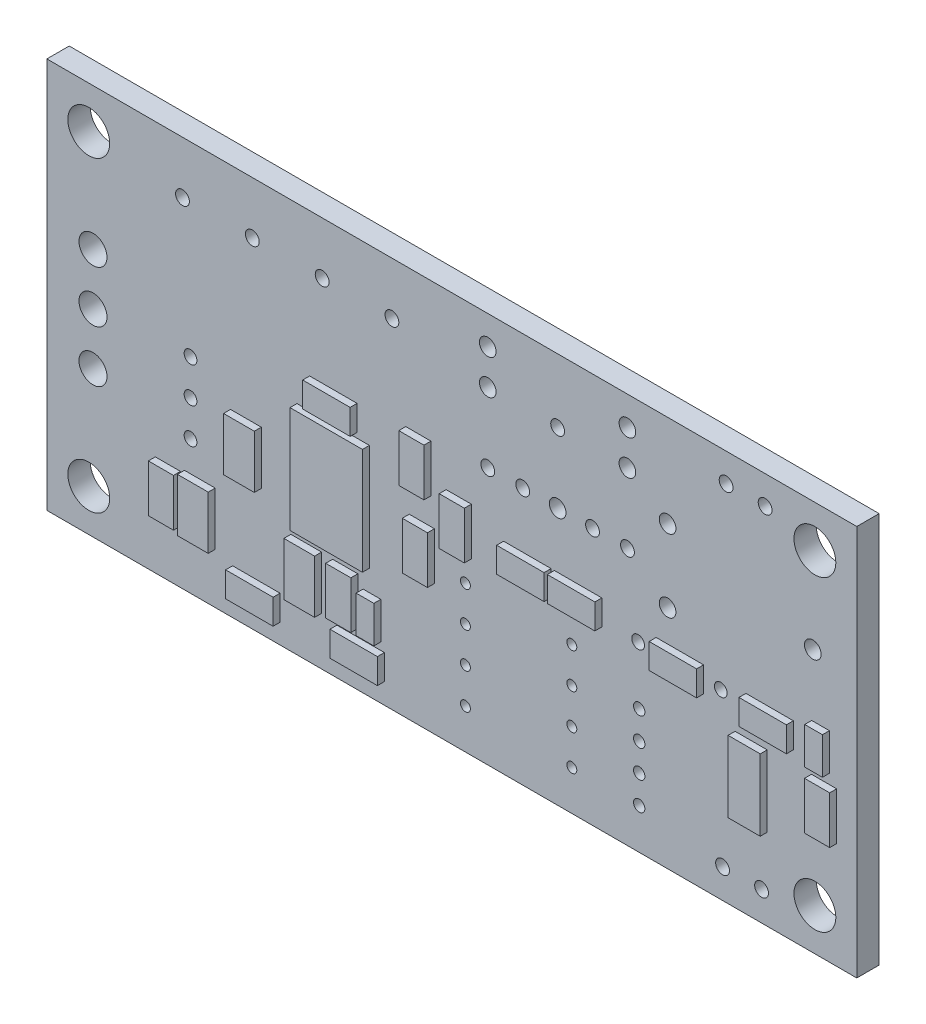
from build123d import *

# Parameters (mm, degrees)
PCB_DGB_W          = 57.99836
PCB_DGB_H          = 28.00096
PCB_DGB_R          = 0.4953
PCB_DGB_R_2        = 0.4064
PCB_DGB_R_3        = 0.3556
PCB_DGB_R_4        = 0.5969
PCB_DGB_R_5        = 0.4572
PCB_DGB_R_6        = 1.0033
PCB_DGB_R_7        = 1.4986
BOSS_EXTRU_1_DEPTH = 1.6
ESQUISSE2_W        = 3.39852
ESQUISSE2_H        = 1.80086
ESQUISSE2_W_2      = 1.27
ESQUISSE2_H_2      = 2.6416
ESQUISSE2_W_3      = 1.80086
ESQUISSE2_H_3      = 3.39852
ESQUISSE2_W_4      = 2.20218
ESQUISSE2_H_4      = 3.80238
ESQUISSE2_H_5      = 3.79984
ESQUISSE2_W_5      = 2.30124
ESQUISSE2_H_6      = 5.11048
BOSS_EXTRU_2_DEPTH = 0.5


with BuildPart() as part:
    # PCB DGB → Boss.-Extru.1 (new body)
    with BuildSketch(Plane.XY):
        with Locations((28.99918, 14.00048)):
            Rectangle(PCB_DGB_W, PCB_DGB_H)
        with Locations((51.181, 2.09296)):
            Circle(PCB_DGB_R, mode=Mode.SUBTRACT)
        with Locations((48.387, 2.09296)):
            Circle(PCB_DGB_R, mode=Mode.SUBTRACT)
        with Locations((51.435, 25.96896)):
            Circle(PCB_DGB_R, mode=Mode.SUBTRACT)
        with Locations((48.641, 25.96896)):
            Circle(PCB_DGB_R, mode=Mode.SUBTRACT)
        with Locations((24.70912, 24.25446)):
            Circle(PCB_DGB_R, mode=Mode.SUBTRACT)
        with Locations((19.71294, 24.25446)):
            Circle(PCB_DGB_R, mode=Mode.SUBTRACT)
        with Locations((14.71168, 24.25446)):
            Circle(PCB_DGB_R, mode=Mode.SUBTRACT)
        with Locations((9.71042, 24.257)):
            Circle(PCB_DGB_R, mode=Mode.SUBTRACT)
        with Locations((36.576, 23.42896)):
            Circle(PCB_DGB_R, mode=Mode.SUBTRACT)
        with Locations((41.57726, 18.4277)):
            Circle(PCB_DGB_R, mode=Mode.SUBTRACT)
        with Locations((39.07536, 18.4277)):
            Circle(PCB_DGB_R, mode=Mode.SUBTRACT)
        with Locations((31.5722, 18.4277)):
            Circle(PCB_DGB_R, mode=Mode.SUBTRACT)
        with Locations((34.0741, 18.4277)):
            Circle(PCB_DGB_R, mode=Mode.SUBTRACT)
        with Locations((42.418, 2.90322)):
            Circle(PCB_DGB_R_2, mode=Mode.SUBTRACT)
        with Locations((42.418, 4.91236)):
            Circle(PCB_DGB_R_2, mode=Mode.SUBTRACT)
        with Locations((42.418, 6.89356)):
            Circle(PCB_DGB_R_2, mode=Mode.SUBTRACT)
        with Locations((42.418, 8.90016)):
            Circle(PCB_DGB_R_2, mode=Mode.SUBTRACT)
        with Locations((29.972, 10.47496)):
            Circle(PCB_DGB_R_3, mode=Mode.SUBTRACT)
        with Locations((29.972, 7.93496)):
            Circle(PCB_DGB_R_3, mode=Mode.SUBTRACT)
        with Locations((29.972, 5.39496)):
            Circle(PCB_DGB_R_3, mode=Mode.SUBTRACT)
        with Locations((29.972, 2.85496)):
            Circle(PCB_DGB_R_3, mode=Mode.SUBTRACT)
        with Locations((37.592, 2.85496)):
            Circle(PCB_DGB_R_3, mode=Mode.SUBTRACT)
        with Locations((37.592, 5.39496)):
            Circle(PCB_DGB_R_3, mode=Mode.SUBTRACT)
        with Locations((37.592, 7.93496)):
            Circle(PCB_DGB_R_3, mode=Mode.SUBTRACT)
        with Locations((37.592, 10.47496)):
            Circle(PCB_DGB_R_3, mode=Mode.SUBTRACT)
        with Locations((54.84876, 18.796)):
            Circle(PCB_DGB_R_4, mode=Mode.SUBTRACT)
        with Locations((44.45, 21.3995)):
            Circle(PCB_DGB_R_4, mode=Mode.SUBTRACT)
        with Locations((44.45, 16.20012)):
            Circle(PCB_DGB_R_4, mode=Mode.SUBTRACT)
        with Locations((36.576, 18.4277)):
            Circle(PCB_DGB_R_4, mode=Mode.SUBTRACT)
        with Locations((41.57218, 23.42896)):
            Circle(PCB_DGB_R_4, mode=Mode.SUBTRACT)
        with Locations((31.5722, 23.42896)):
            Circle(PCB_DGB_R_4, mode=Mode.SUBTRACT)
        with Locations((41.57218, 25.92832)):
            Circle(PCB_DGB_R_4, mode=Mode.SUBTRACT)
        with Locations((31.5722, 25.92832)):
            Circle(PCB_DGB_R_4, mode=Mode.SUBTRACT)
        with Locations((42.3418, 13.01496)):
            Circle(PCB_DGB_R_5, mode=Mode.SUBTRACT)
        with Locations((48.26, 13.01496)):
            Circle(PCB_DGB_R_5, mode=Mode.SUBTRACT)
        with Locations((10.287, 9.58596)):
            Circle(PCB_DGB_R_5, mode=Mode.SUBTRACT)
        with Locations((10.287, 12.12596)):
            Circle(PCB_DGB_R_5, mode=Mode.SUBTRACT)
        with Locations((10.287, 14.66596)):
            Circle(PCB_DGB_R_5, mode=Mode.SUBTRACT)
        with Locations((3.302, 17.84096)):
            Circle(PCB_DGB_R_6, mode=Mode.SUBTRACT)
        with Locations((3.302, 14.14018)):
            Circle(PCB_DGB_R_6, mode=Mode.SUBTRACT)
        with Locations((3.302, 10.44194)):
            Circle(PCB_DGB_R_6, mode=Mode.SUBTRACT)
        with Locations((54.99862, 25.00122)):
            Circle(PCB_DGB_R_7, mode=Mode.SUBTRACT)
        with Locations((54.99862, 2.99974)):
            Circle(PCB_DGB_R_7, mode=Mode.SUBTRACT)
        with Locations((2.99974, 2.99974)):
            Circle(PCB_DGB_R_7, mode=Mode.SUBTRACT)
        with Locations((2.99974, 25.00122)):
            Circle(PCB_DGB_R_7, mode=Mode.SUBTRACT)
    extrude(amount=BOSS_EXTRU_1_DEPTH)

    # Esquisse2 → Boss.-Extru.2 (add)
    with BuildSketch(Plane.XY.offset(1.6)):
        with Locations((51.758314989, 12.782054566)):
            Rectangle(ESQUISSE2_W, ESQUISSE2_H)
        with Locations((20.516314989, 16.846054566)):
            Rectangle(ESQUISSE2_W, ESQUISSE2_H)
        with Locations((14.999434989, 2.314714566)):
            Rectangle(ESQUISSE2_W, ESQUISSE2_H)
        with Locations((23.279834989, 5.122684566)):
            Rectangle(ESQUISSE2_W_2, ESQUISSE2_H_2)
        with Locations((22.469574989, 2.368054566)):
            Rectangle(ESQUISSE2_W, ESQUISSE2_H)
        with Locations((21.365944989, 5.503684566)):
            Rectangle(ESQUISSE2_W_3, ESQUISSE2_H_3)
        with Locations((8.665944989, 5.503684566)):
            Rectangle(ESQUISSE2_W_3, ESQUISSE2_H_3)
        with Locations((10.951944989, 5.510034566)):
            Rectangle(ESQUISSE2_W_4, ESQUISSE2_H_4)
        with Locations((18.571944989, 5.351284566)):
            Rectangle(ESQUISSE2_W_4, ESQUISSE2_H_5)
        with Locations((34.407574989, 13.544054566)):
            Rectangle(ESQUISSE2_W, ESQUISSE2_H)
        with Locations((38.042314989, 13.544054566)):
            Rectangle(ESQUISSE2_W, ESQUISSE2_H)
        with Locations((29.493944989, 13.885684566)):
            Rectangle(ESQUISSE2_W_3, ESQUISSE2_H_3)
        with Locations((45.329574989, 13.036054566)):
            Rectangle(ESQUISSE2_W, ESQUISSE2_H)
        with Locations((50.432434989, 8.386584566)):
            Rectangle(ESQUISSE2_W_5, ESQUISSE2_H_6)
        with Locations((55.655944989, 9.313684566)):
            Rectangle(ESQUISSE2_W_3, ESQUISSE2_H_3)
        with Locations((55.403214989, 13.037324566)):
            Rectangle(ESQUISSE2_W_2, ESQUISSE2_H_2)
        Polygon((17.910274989, 15.579864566), (17.910274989, 7.959864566), (23.094414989, 7.959864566), (23.094414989, 15.579864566), (23.066474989, 15.579864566), align=None)
        with Locations((26.600884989, 16.349484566)):
            Rectangle(ESQUISSE2_W_3, ESQUISSE2_H_3)
        with Locations((14.253944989, 10.939284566)):
            Rectangle(ESQUISSE2_W_4, ESQUISSE2_H_5)
        with Locations((26.852344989, 11.040884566)):
            Rectangle(ESQUISSE2_W_3, ESQUISSE2_H_3)
    extrude(amount=BOSS_EXTRU_2_DEPTH)


solid = part.part
